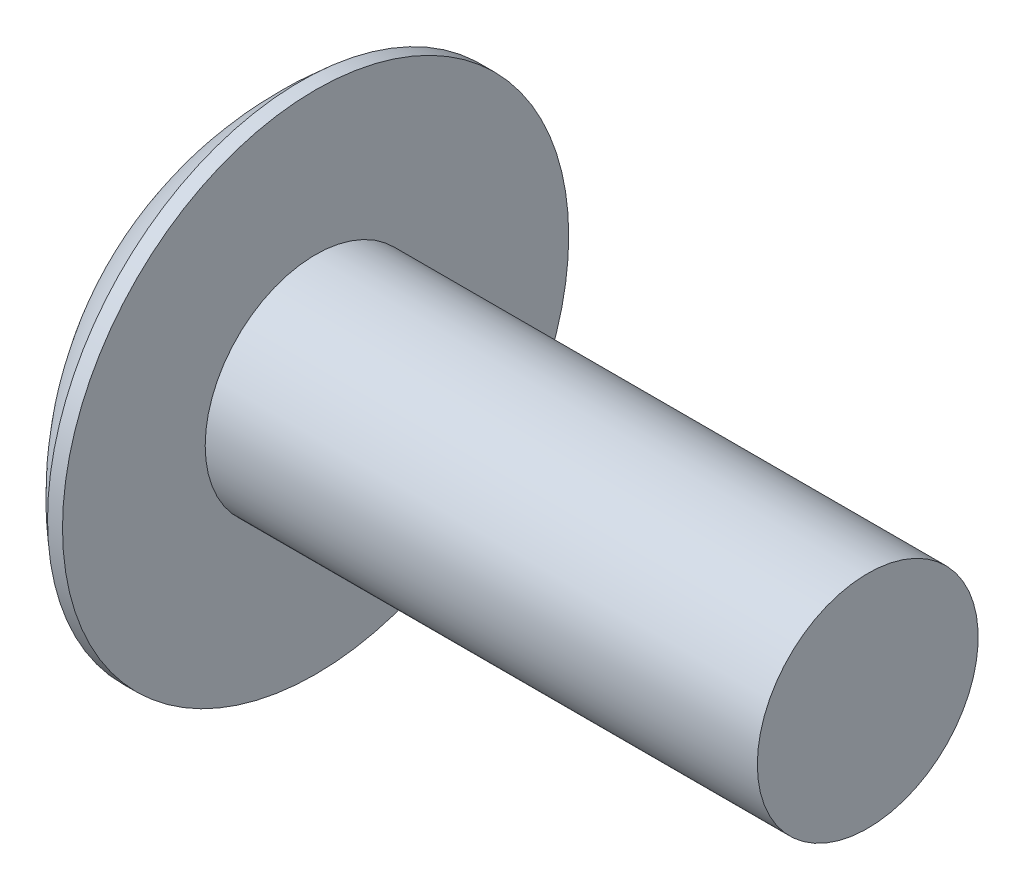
from build123d import *

# Parameters (mm, degrees)
CIRPATTERN1_COUNT = 2
CIRPATTERN1_ANGLE = 90


with BuildPart() as part:
    # BodySke → Base-Revolve (revolve)
    with BuildSketch(Plane.XY, mode=Mode.PRIVATE) as base_revolve_sk:
        with BuildLine():
            Line((3.81, 3.175), (3.81, 7.2771))
            Line((3.81, 7.2771), (3.379315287, 7.2771))
            ThreePointArc((3.379315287, 7.2771), (0.886039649, 4.011731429), (0, 0))
            Line((0, 0), (19.685, 0))
            Line((19.685, 0), (19.685, 3.175))
            Line((19.685, 3.175), (3.81, 3.175))
        make_face()
    revolve(base_revolve_sk.sketch.rotate(Axis((-25.4, 0, 0), (1, 0, 0)), 90), axis=Axis((-25.4, 0, 0), (1, 0, 0)))

    # Sketch3 → Cross section 0
    with BuildSketch(Plane(origin=(0, 0, 0), x_dir=(0, 0, -1), z_dir=(1, 0, 0))):
        with BuildLine():
            Line((0.7239, -4.0767), (-0.7239, -4.0767))
            Line((-0.7239, -4.0767), (-0.7239, 4.0767))
            Line((-0.7239, 4.0767), (0.7239, 4.0767))
            Line((0.7239, 4.0767), (0.7239, -4.0767))
        make_face()
    # Sketch4 → Cross section 1
    with BuildSketch(Plane(origin=(4.6228, 0, 0), x_dir=(0, 0, -1), z_dir=(1, 0, 0))):
        with BuildLine():
            Line((0.36195, -0.36195), (-0.36195, -0.36195))
            Line((-0.36195, -0.36195), (-0.36195, 0.36195))
            Line((-0.36195, 0.36195), (0.36195, 0.36195))
            Line((0.36195, 0.36195), (0.36195, -0.36195))
        make_face()
    cross = loft(mode=Mode.SUBTRACT)

    # CirPattern1: Cross ×2 about axis
    cirpattern1_axis = Axis((0, 0, 0), (1, 0, 0))
    for i in range(1, CIRPATTERN1_COUNT):
        add(cross.rotate(cirpattern1_axis, i * CIRPATTERN1_ANGLE / (CIRPATTERN1_COUNT - 1)), mode=Mode.SUBTRACT)


solid = part.part
